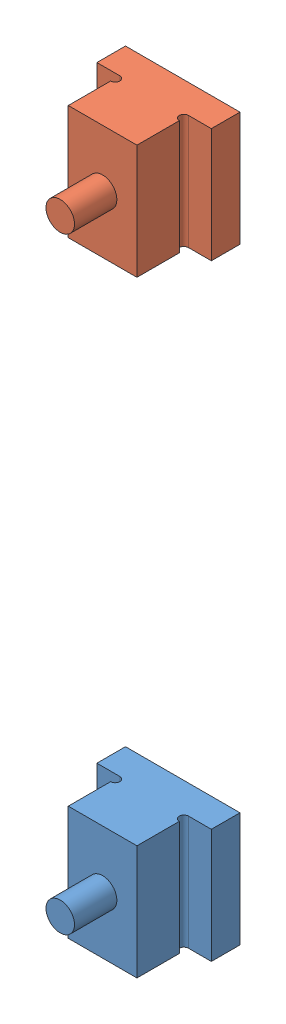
SolidWorks assembly img125_160-20k.SLDASM, configuration Default (file format 16000). Lengths in mm.
Overall size (20 126 21.4).
2 component instances, 2 part files, 0 mates.
Components (placement in the parent):
- img125_160-20k_01-1: img125_160-20k_01.SLDPRT [Default] at origin size (20 20 21.4)
- img125_160-20k_02-1: img125_160-20k_02.SLDPRT [Default] at (0 106 0) size (20 20 21.4)
